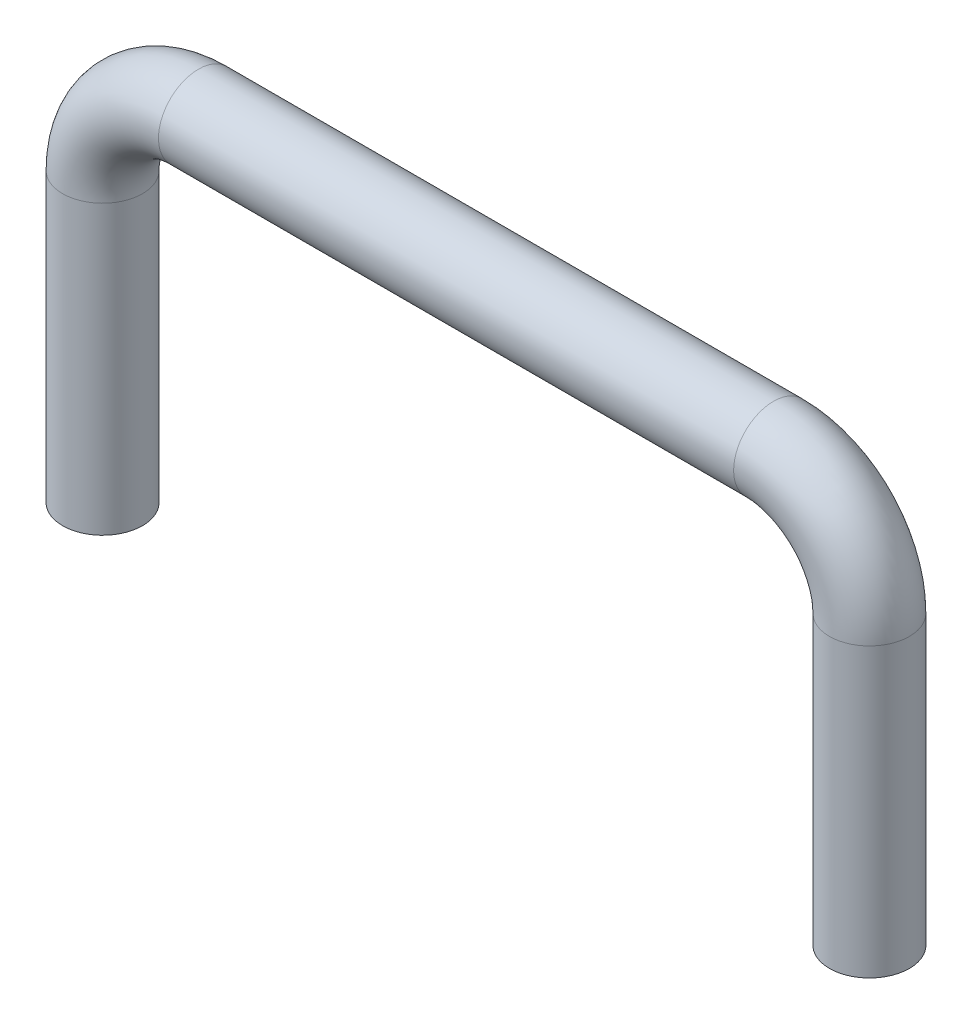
ISO-10303-21;
HEADER;
FILE_DESCRIPTION(('STEP AP214'),'2;1');
FILE_NAME('part.step','',(''),(''),'','','');
FILE_SCHEMA(('AUTOMOTIVE_DESIGN { 1 0 10303 214 1 1 1 1 }'));
ENDSEC;
DATA;
#1=APPLICATION_CONTEXT('core data for automotive mechanical design processes');
#2=APPLICATION_PROTOCOL_DEFINITION('international standard','automotive_design',2000,#1);
#3=PRODUCT_CONTEXT('',#1,'mechanical');
#4=PRODUCT('Part','Part','',(#3));
#5=PRODUCT_RELATED_PRODUCT_CATEGORY('part','',(#4));
#6=PRODUCT_DEFINITION_FORMATION('','',#4);
#7=PRODUCT_DEFINITION_CONTEXT('part definition',#1,'design');
#8=PRODUCT_DEFINITION('design','',#6,#7);
#9=PRODUCT_DEFINITION_SHAPE('','',#8);
#10=(LENGTH_UNIT() NAMED_UNIT(*) SI_UNIT(.MILLI.,.METRE.));
#11=(NAMED_UNIT(*) PLANE_ANGLE_UNIT() SI_UNIT($,.RADIAN.));
#12=(NAMED_UNIT(*) SI_UNIT($,.STERADIAN.) SOLID_ANGLE_UNIT());
#13=UNCERTAINTY_MEASURE_WITH_UNIT(LENGTH_MEASURE(1.E-05),#10,'distance_accuracy_value','');
#14=(GEOMETRIC_REPRESENTATION_CONTEXT(3) GLOBAL_UNCERTAINTY_ASSIGNED_CONTEXT((#13)) GLOBAL_UNIT_ASSIGNED_CONTEXT((#10,
#11,#12)) REPRESENTATION_CONTEXT('',''));
#15=CARTESIAN_POINT('',(0.,0.,0.));
#16=DIRECTION('',(0.,0.,1.));
#17=DIRECTION('',(1.,0.,0.));
#18=AXIS2_PLACEMENT_3D('',#15,#16,#17);
#19=CARTESIAN_POINT('',(-76.2,57.15,0.));
#20=DIRECTION('',(0.,-1.,0.));
#21=DIRECTION('',(0.,0.,-1.));
#22=AXIS2_PLACEMENT_3D('',#19,#20,#21);
#23=CYLINDRICAL_SURFACE('',#22,7.93749999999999);
#24=CARTESIAN_POINT('',(-76.2,57.15,0.));
#25=DIRECTION('',(0.,-1.,0.));
#26=DIRECTION('',(0.,0.,1.));
#27=AXIS2_PLACEMENT_3D('',#24,#25,#26);
#28=CIRCLE('',#27,7.93749999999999);
#29=CARTESIAN_POINT('',(-84.1375,57.15,0.));
#30=VERTEX_POINT('',#29);
#31=EDGE_CURVE('E18',#30,#30,#28,.T.);
#32=ORIENTED_EDGE('',*,*,#31,.T.);
#33=EDGE_LOOP('',(#32));
#34=FACE_BOUND('',#33,.T.);
#35=CARTESIAN_POINT('',(-76.2,0.,0.));
#36=DIRECTION('',(0.,-1.,0.));
#37=DIRECTION('',(0.,0.,1.));
#38=AXIS2_PLACEMENT_3D('',#35,#36,#37);
#39=CIRCLE('',#38,7.93749999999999);
#40=CARTESIAN_POINT('',(-76.2,0.,7.93749999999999));
#41=VERTEX_POINT('',#40);
#42=EDGE_CURVE('E8',#41,#41,#39,.T.);
#43=ORIENTED_EDGE('',*,*,#42,.F.);
#44=EDGE_LOOP('',(#43));
#45=FACE_BOUND('',#44,.T.);
#46=ADVANCED_FACE('F12',(#34,#45),#23,.T.);
#47=CARTESIAN_POINT('',(-57.15,57.15,0.));
#48=DIRECTION('',(0.,0.,1.));
#49=DIRECTION('',(1.,0.,0.));
#50=AXIS2_PLACEMENT_3D('',#47,#48,#49);
#51=TOROIDAL_SURFACE('',#50,19.05,7.93749999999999);
#52=CARTESIAN_POINT('',(-57.15,76.2,0.));
#53=DIRECTION('',(-1.,0.,0.));
#54=DIRECTION('',(0.,0.,1.));
#55=AXIS2_PLACEMENT_3D('',#52,#53,#54);
#56=CIRCLE('',#55,7.93749999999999);
#57=CARTESIAN_POINT('',(-57.15,84.1375,0.));
#58=VERTEX_POINT('',#57);
#59=EDGE_CURVE('E22',#58,#58,#56,.T.);
#60=CARTESIAN_POINT('',(-57.15,57.15,0.));
#61=DIRECTION('',(0.,0.,1.));
#62=DIRECTION('',(1.,0.,0.));
#63=AXIS2_PLACEMENT_3D('',#60,#61,#62);
#64=CIRCLE('',#63,26.9875);
#65=EDGE_CURVE('',#58,#30,#64,.T.);
#66=ORIENTED_EDGE('',*,*,#59,.T.);
#67=ORIENTED_EDGE('',*,*,#31,.F.);
#68=ORIENTED_EDGE('',*,*,#65,.T.);
#69=ORIENTED_EDGE('',*,*,#65,.F.);
#70=EDGE_LOOP('',(#66,#68,#67,#69));
#71=FACE_BOUND('',#70,.T.);
#72=ADVANCED_FACE('F54',(#71),#51,.T.);
#73=CARTESIAN_POINT('',(57.15,76.2,0.));
#74=DIRECTION('',(-1.,0.,0.));
#75=DIRECTION('',(0.,0.,1.));
#76=AXIS2_PLACEMENT_3D('',#73,#74,#75);
#77=CYLINDRICAL_SURFACE('',#76,7.93749999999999);
#78=CARTESIAN_POINT('',(57.15,76.2,0.));
#79=DIRECTION('',(-1.,0.,0.));
#80=DIRECTION('',(0.,0.,1.));
#81=AXIS2_PLACEMENT_3D('',#78,#79,#80);
#82=CIRCLE('',#81,7.93749999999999);
#83=CARTESIAN_POINT('',(57.15,84.1375,0.));
#84=VERTEX_POINT('',#83);
#85=EDGE_CURVE('E26',#84,#84,#82,.T.);
#86=ORIENTED_EDGE('',*,*,#85,.T.);
#87=EDGE_LOOP('',(#86));
#88=FACE_BOUND('',#87,.T.);
#89=ORIENTED_EDGE('',*,*,#59,.F.);
#90=EDGE_LOOP('',(#89));
#91=FACE_BOUND('',#90,.T.);
#92=ADVANCED_FACE('F58',(#88,#91),#77,.T.);
#93=CARTESIAN_POINT('',(57.15,57.15,0.));
#94=DIRECTION('',(0.,0.,1.));
#95=DIRECTION('',(1.,0.,0.));
#96=AXIS2_PLACEMENT_3D('',#93,#94,#95);
#97=TOROIDAL_SURFACE('',#96,19.05,7.93749999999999);
#98=CARTESIAN_POINT('',(76.2,57.15,0.));
#99=DIRECTION('',(0.,1.,0.));
#100=DIRECTION('',(0.,0.,1.));
#101=AXIS2_PLACEMENT_3D('',#98,#99,#100);
#102=CIRCLE('',#101,7.93749999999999);
#103=CARTESIAN_POINT('',(84.1375,57.15,0.));
#104=VERTEX_POINT('',#103);
#105=EDGE_CURVE('E31',#104,#104,#102,.T.);
#106=CARTESIAN_POINT('',(57.15,57.15,0.));
#107=DIRECTION('',(0.,0.,1.));
#108=DIRECTION('',(1.,0.,0.));
#109=AXIS2_PLACEMENT_3D('',#106,#107,#108);
#110=CIRCLE('',#109,26.9875);
#111=EDGE_CURVE('',#104,#84,#110,.T.);
#112=ORIENTED_EDGE('',*,*,#105,.T.);
#113=ORIENTED_EDGE('',*,*,#85,.F.);
#114=ORIENTED_EDGE('',*,*,#111,.T.);
#115=ORIENTED_EDGE('',*,*,#111,.F.);
#116=EDGE_LOOP('',(#112,#114,#113,#115));
#117=FACE_BOUND('',#116,.T.);
#118=ADVANCED_FACE('F49',(#117),#97,.T.);
#119=CARTESIAN_POINT('',(76.2,57.15,0.));
#120=DIRECTION('',(0.,-1.,0.));
#121=DIRECTION('',(0.,0.,-1.));
#122=AXIS2_PLACEMENT_3D('',#119,#120,#121);
#123=CYLINDRICAL_SURFACE('',#122,7.93749999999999);
#124=ORIENTED_EDGE('',*,*,#105,.F.);
#125=EDGE_LOOP('',(#124));
#126=FACE_BOUND('',#125,.T.);
#127=CARTESIAN_POINT('',(76.2,0.,0.));
#128=DIRECTION('',(0.,1.,0.));
#129=DIRECTION('',(0.,0.,1.));
#130=AXIS2_PLACEMENT_3D('',#127,#128,#129);
#131=CIRCLE('',#130,7.93749999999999);
#132=CARTESIAN_POINT('',(76.2,0.,7.93749999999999));
#133=VERTEX_POINT('',#132);
#134=EDGE_CURVE('E34',#133,#133,#131,.T.);
#135=ORIENTED_EDGE('',*,*,#134,.T.);
#136=EDGE_LOOP('',(#135));
#137=FACE_BOUND('',#136,.T.);
#138=ADVANCED_FACE('F38',(#126,#137),#123,.T.);
#139=CARTESIAN_POINT('',(-76.2,0.,0.));
#140=DIRECTION('',(0.,-1.,0.));
#141=DIRECTION('',(0.,0.,1.));
#142=AXIS2_PLACEMENT_3D('',#139,#140,#141);
#143=PLANE('',#142);
#144=ORIENTED_EDGE('',*,*,#42,.T.);
#145=EDGE_LOOP('',(#144));
#146=FACE_BOUND('',#145,.T.);
#147=ADVANCED_FACE('F42',(#146),#143,.T.);
#148=CARTESIAN_POINT('',(76.2,0.,0.));
#149=DIRECTION('',(0.,1.,0.));
#150=DIRECTION('',(0.,0.,1.));
#151=AXIS2_PLACEMENT_3D('',#148,#149,#150);
#152=PLANE('',#151);
#153=ORIENTED_EDGE('',*,*,#134,.F.);
#154=EDGE_LOOP('',(#153));
#155=FACE_BOUND('',#154,.T.);
#156=ADVANCED_FACE('F40',(#155),#152,.F.);
#157=CLOSED_SHELL('',(#46,#72,#92,#118,#138,#147,#156));
#158=MANIFOLD_SOLID_BREP('B1',#157);
#159=ADVANCED_BREP_SHAPE_REPRESENTATION('',(#18,#158),#14);
#160=SHAPE_DEFINITION_REPRESENTATION(#9,#159);
ENDSEC;
END-ISO-10303-21;
